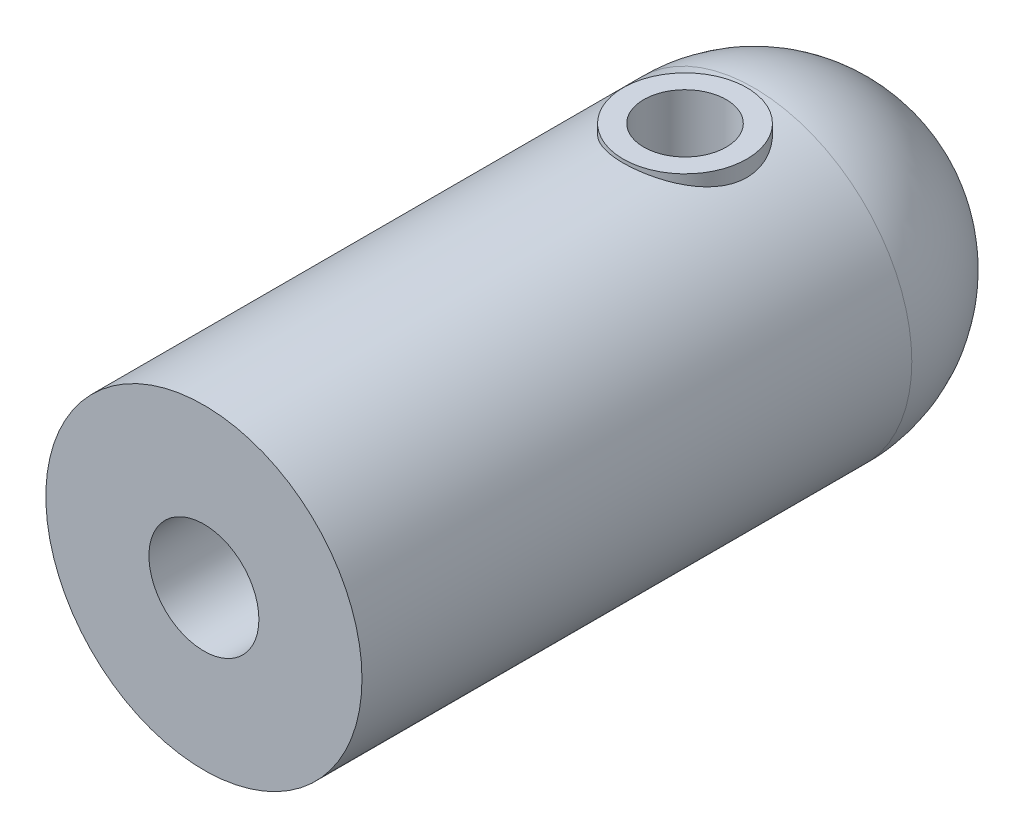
ISO-10303-21;
HEADER;
FILE_DESCRIPTION(('STEP AP214'),'2;1');
FILE_NAME('part.step','',(''),(''),'','','');
FILE_SCHEMA(('AUTOMOTIVE_DESIGN { 1 0 10303 214 1 1 1 1 }'));
ENDSEC;
DATA;
#1=APPLICATION_CONTEXT('core data for automotive mechanical design processes');
#2=APPLICATION_PROTOCOL_DEFINITION('international standard','automotive_design',2000,#1);
#3=PRODUCT_CONTEXT('',#1,'mechanical');
#4=PRODUCT('Part','Part','',(#3));
#5=PRODUCT_RELATED_PRODUCT_CATEGORY('part','',(#4));
#6=PRODUCT_DEFINITION_FORMATION('','',#4);
#7=PRODUCT_DEFINITION_CONTEXT('part definition',#1,'design');
#8=PRODUCT_DEFINITION('design','',#6,#7);
#9=PRODUCT_DEFINITION_SHAPE('','',#8);
#10=(LENGTH_UNIT() NAMED_UNIT(*) SI_UNIT(.MILLI.,.METRE.));
#11=(NAMED_UNIT(*) PLANE_ANGLE_UNIT() SI_UNIT($,.RADIAN.));
#12=(NAMED_UNIT(*) SI_UNIT($,.STERADIAN.) SOLID_ANGLE_UNIT());
#13=UNCERTAINTY_MEASURE_WITH_UNIT(LENGTH_MEASURE(1.E-05),#10,'distance_accuracy_value','');
#14=(GEOMETRIC_REPRESENTATION_CONTEXT(3) GLOBAL_UNCERTAINTY_ASSIGNED_CONTEXT((#13)) GLOBAL_UNIT_ASSIGNED_CONTEXT((#10,
#11,#12)) REPRESENTATION_CONTEXT('',''));
#15=CARTESIAN_POINT('',(0.,0.,0.));
#16=DIRECTION('',(0.,0.,1.));
#17=DIRECTION('',(1.,0.,0.));
#18=AXIS2_PLACEMENT_3D('',#15,#16,#17);
#19=CARTESIAN_POINT('',(0.,0.,80.));
#20=DIRECTION('',(0.,0.,-1.));
#21=DIRECTION('',(-1.,0.,0.));
#22=AXIS2_PLACEMENT_3D('',#19,#20,#21);
#23=CYLINDRICAL_SURFACE('',#22,23.);
#24=CARTESIAN_POINT('',(0.,0.,0.));
#25=DIRECTION('',(0.,0.,1.));
#26=DIRECTION('',(1.,0.,0.));
#27=AXIS2_PLACEMENT_3D('',#24,#25,#26);
#28=CIRCLE('',#27,23.);
#29=CARTESIAN_POINT('',(23.,0.,0.));
#30=VERTEX_POINT('',#29);
#31=EDGE_CURVE('E67',#30,#30,#28,.T.);
#32=ORIENTED_EDGE('',*,*,#31,.T.);
#33=EDGE_LOOP('',(#32));
#34=FACE_BOUND('',#33,.T.);
#35=CARTESIAN_POINT('',(0.,0.,80.));
#36=DIRECTION('',(0.,0.,1.));
#37=DIRECTION('',(1.,0.,0.));
#38=AXIS2_PLACEMENT_3D('',#35,#36,#37);
#39=CIRCLE('',#38,23.);
#40=CARTESIAN_POINT('',(23.,0.,80.));
#41=VERTEX_POINT('',#40);
#42=EDGE_CURVE('E41',#41,#41,#39,.T.);
#43=ORIENTED_EDGE('',*,*,#42,.F.);
#44=EDGE_LOOP('',(#43));
#45=FACE_BOUND('',#44,.T.);
#46=CARTESIAN_POINT('',(0.,23.,19.));
#47=CARTESIAN_POINT('',(0.242913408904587,23.0000012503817,19.0000016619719));
#48=CARTESIAN_POINT('',(0.485805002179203,22.9961436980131,18.990158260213));
#49=CARTESIAN_POINT('',(0.969758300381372,22.9808215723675,18.9508934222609));
#50=CARTESIAN_POINT('',(1.21082007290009,22.9693572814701,18.921472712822));
#51=CARTESIAN_POINT('',(1.68926120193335,22.9391335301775,18.8433669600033));
#52=CARTESIAN_POINT('',(1.92664154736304,22.9203760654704,18.7946871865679));
#53=CARTESIAN_POINT('',(2.39611476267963,22.8760624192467,18.6785431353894));
#54=CARTESIAN_POINT('',(2.62820744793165,22.8505060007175,18.6110782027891));
#55=CARTESIAN_POINT('',(3.08501553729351,22.7933225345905,18.4581655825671));
#56=CARTESIAN_POINT('',(3.30974653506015,22.7617094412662,18.3727591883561));
#57=CARTESIAN_POINT('',(3.75105355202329,22.6931594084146,18.1845685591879));
#58=CARTESIAN_POINT('',(3.96762669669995,22.6562206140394,18.0817782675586));
#59=CARTESIAN_POINT('',(4.39124296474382,22.5779401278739,17.8596551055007));
#60=CARTESIAN_POINT('',(4.59828720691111,22.5365989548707,17.7403241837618));
#61=CARTESIAN_POINT('',(5.00180657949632,22.4504902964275,17.4859097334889));
#62=CARTESIAN_POINT('',(5.19827784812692,22.4057215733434,17.3508205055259));
#63=CARTESIAN_POINT('',(5.58735624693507,22.3119501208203,17.0599460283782));
#64=CARTESIAN_POINT('',(5.77947557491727,22.2628490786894,16.9035397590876));
#65=CARTESIAN_POINT('',(6.14999733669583,22.1633557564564,16.5756173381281));
#66=CARTESIAN_POINT('',(6.32839932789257,22.1129634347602,16.4041006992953));
#67=CARTESIAN_POINT('',(6.67056995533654,22.012163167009,16.0468750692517));
#68=CARTESIAN_POINT('',(6.83433124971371,21.9617552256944,15.8611590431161));
#69=CARTESIAN_POINT('',(7.14610539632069,21.8622951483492,15.4767151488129));
#70=CARTESIAN_POINT('',(7.29412351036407,21.8132425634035,15.2779916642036));
#71=CARTESIAN_POINT('',(7.57951436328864,21.715770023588,14.8598092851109));
#72=CARTESIAN_POINT('',(7.71616168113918,21.6674667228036,14.6398271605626));
#73=CARTESIAN_POINT('',(7.97028137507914,21.575284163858,14.1882815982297));
#74=CARTESIAN_POINT('',(8.08776149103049,21.531403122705,13.9567228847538));
#75=CARTESIAN_POINT('',(8.30258552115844,21.4494824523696,13.4834736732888));
#76=CARTESIAN_POINT('',(8.39993193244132,21.41144209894,13.2417844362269));
#77=CARTESIAN_POINT('',(8.57354737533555,21.3425167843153,12.7499598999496));
#78=CARTESIAN_POINT('',(8.64981776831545,21.3116313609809,12.4998251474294));
#79=CARTESIAN_POINT('',(8.77758639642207,21.2593164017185,12.0041414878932));
#80=CARTESIAN_POINT('',(8.83002395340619,21.2375317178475,11.7588721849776));
#81=CARTESIAN_POINT('',(8.9142960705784,21.2022975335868,11.2642233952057));
#82=CARTESIAN_POINT('',(8.94613120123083,21.1888478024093,11.0148440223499));
#83=CARTESIAN_POINT('',(8.98881807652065,21.1707744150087,10.5140753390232));
#84=CARTESIAN_POINT('',(8.9996781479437,21.1661472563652,10.2626868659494));
#85=CARTESIAN_POINT('',(9.00030770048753,21.1658797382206,9.75988428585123));
#86=CARTESIAN_POINT('',(8.99007810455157,21.170238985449,9.50847018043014));
#87=CARTESIAN_POINT('',(8.9500333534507,21.1871972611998,9.02432935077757));
#88=CARTESIAN_POINT('',(8.92156333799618,21.1992301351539,8.79146994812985));
#89=CARTESIAN_POINT('',(8.84663246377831,21.2306086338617,8.32908254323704));
#90=CARTESIAN_POINT('',(8.80016536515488,21.2499567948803,8.09955572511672));
#91=CARTESIAN_POINT('',(8.68970417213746,21.2953656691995,7.64551024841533));
#92=CARTESIAN_POINT('',(8.62571458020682,21.3214246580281,7.4209903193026));
#93=CARTESIAN_POINT('',(8.48074727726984,21.3794999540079,6.97820949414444));
#94=CARTESIAN_POINT('',(8.39976304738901,21.4115185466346,6.75995103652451));
#95=CARTESIAN_POINT('',(8.21973587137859,21.4812810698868,6.32685315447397));
#96=CARTESIAN_POINT('',(8.12037138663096,21.5191245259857,6.11216354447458));
#97=CARTESIAN_POINT('',(7.90539571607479,21.5990246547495,5.69181371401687));
#98=CARTESIAN_POINT('',(7.7897790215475,21.6410827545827,5.48615658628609));
#99=CARTESIAN_POINT('',(7.54308670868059,21.7282984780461,5.08499255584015));
#100=CARTESIAN_POINT('',(7.41200908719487,21.7734565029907,4.88948697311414));
#101=CARTESIAN_POINT('',(7.13519874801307,21.8657316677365,4.50962890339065));
#102=CARTESIAN_POINT('',(6.98946537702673,21.9128488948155,4.32527691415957));
#103=CARTESIAN_POINT('',(6.67285447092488,22.0114172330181,3.95545190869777));
#104=CARTESIAN_POINT('',(6.50091452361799,22.0629311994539,3.77090384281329));
#105=CARTESIAN_POINT('',(6.1421464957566,22.1654873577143,3.41687511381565));
#106=CARTESIAN_POINT('',(5.95532286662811,22.2165296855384,3.24738997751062));
#107=CARTESIAN_POINT('',(5.56770760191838,22.316826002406,2.92438638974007));
#108=CARTESIAN_POINT('',(5.36690820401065,22.3660789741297,2.77087693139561));
#109=CARTESIAN_POINT('',(4.95268367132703,22.4614351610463,2.48103764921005));
#110=CARTESIAN_POINT('',(4.73926362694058,22.5075396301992,2.34470096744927));
#111=CARTESIAN_POINT('',(4.29690439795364,22.5962039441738,2.08777868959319));
#112=CARTESIAN_POINT('',(4.06774970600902,22.6386814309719,1.96753512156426));
#113=CARTESIAN_POINT('',(3.59920700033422,22.7178812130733,1.74695675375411));
#114=CARTESIAN_POINT('',(3.35982339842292,22.7546059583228,1.64661347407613));
#115=CARTESIAN_POINT('',(2.87247466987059,22.8212479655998,1.46675095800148));
#116=CARTESIAN_POINT('',(2.62451100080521,22.8511663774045,1.38722820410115));
#117=CARTESIAN_POINT('',(2.12186963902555,22.9033074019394,1.24982645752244));
#118=CARTESIAN_POINT('',(1.86719238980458,22.9255305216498,1.19194603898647));
#119=CARTESIAN_POINT('',(1.36788409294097,22.9605729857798,1.10114847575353));
#120=CARTESIAN_POINT('',(1.12351000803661,22.9738569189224,1.06699440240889));
#121=CARTESIAN_POINT('',(0.632486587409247,22.9926142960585,1.01886381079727));
#122=CARTESIAN_POINT('',(0.385837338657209,22.9980880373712,1.00488652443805));
#123=CARTESIAN_POINT('',(-0.107769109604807,23.0010714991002,0.997261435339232));
#124=CARTESIAN_POINT('',(-0.354726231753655,22.9985829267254,1.00360927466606));
#125=CARTESIAN_POINT('',(-0.847075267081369,22.9857151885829,1.0365557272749));
#126=CARTESIAN_POINT('',(-1.09246720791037,22.9753361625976,1.06315398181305));
#127=CARTESIAN_POINT('',(-1.56935068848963,22.9475865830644,1.1347439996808));
#128=CARTESIAN_POINT('',(-1.80098720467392,22.9305347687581,1.17889851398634));
#129=CARTESIAN_POINT('',(-2.25961975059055,22.8898915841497,1.28509649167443));
#130=CARTESIAN_POINT('',(-2.48661412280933,22.8662979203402,1.34714622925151));
#131=CARTESIAN_POINT('',(-2.93434964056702,22.813163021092,1.48855501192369));
#132=CARTESIAN_POINT('',(-3.15509256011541,22.7836234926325,1.56790908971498));
#133=CARTESIAN_POINT('',(-3.58914028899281,22.719292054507,1.74331254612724));
#134=CARTESIAN_POINT('',(-3.80244223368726,22.6844981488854,1.83936827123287));
#135=CARTESIAN_POINT('',(-4.22655580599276,22.6093781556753,2.05053430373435));
#136=CARTESIAN_POINT('',(-4.43710300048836,22.5689179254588,2.1661278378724));
#137=CARTESIAN_POINT('',(-4.84781833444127,22.4842754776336,2.41342353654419));
#138=CARTESIAN_POINT('',(-5.04798288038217,22.4400919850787,2.54513122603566));
#139=CARTESIAN_POINT('',(-5.43682041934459,22.3490685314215,2.82377517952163));
#140=CARTESIAN_POINT('',(-5.6254915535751,22.3022281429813,2.97071389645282));
#141=CARTESIAN_POINT('',(-5.99033393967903,22.2070135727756,3.27891890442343));
#142=CARTESIAN_POINT('',(-6.16650465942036,22.1586393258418,3.44018580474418));
#143=CARTESIAN_POINT('',(-6.51619009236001,22.0584318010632,3.78681601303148));
#144=CARTESIAN_POINT('',(-6.6888269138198,22.006573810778,3.97305901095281));
#145=CARTESIAN_POINT('',(-7.01782262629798,21.9038777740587,4.35956088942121));
#146=CARTESIAN_POINT('',(-7.17418662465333,21.8530394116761,4.55981533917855));
#147=CARTESIAN_POINT('',(-7.46976593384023,21.7537794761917,4.9733487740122));
#148=CARTESIAN_POINT('',(-7.60897185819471,21.7053592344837,5.18663479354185));
#149=CARTESIAN_POINT('',(-7.86907660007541,21.612420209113,5.6247844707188));
#150=CARTESIAN_POINT('',(-7.98998311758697,21.5678997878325,5.84964320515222));
#151=CARTESIAN_POINT('',(-8.21348545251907,21.4837855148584,6.31150416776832));
#152=CARTESIAN_POINT('',(-8.31592457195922,21.4442346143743,6.54859019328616));
#153=CARTESIAN_POINT('',(-8.50027730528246,21.3718295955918,7.03149123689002));
#154=CARTESIAN_POINT('',(-8.58220015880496,21.3389724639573,7.27730226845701));
#155=CARTESIAN_POINT('',(-8.72469871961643,21.2811079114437,7.77585518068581));
#156=CARTESIAN_POINT('',(-8.78528190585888,21.2560977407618,8.02859459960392));
#157=CARTESIAN_POINT('',(-8.88443720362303,21.2148455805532,8.53905538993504));
#158=CARTESIAN_POINT('',(-8.92301104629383,21.1986029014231,8.79677636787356));
#159=CARTESIAN_POINT('',(-8.9757806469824,21.1763102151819,9.29702827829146));
#160=CARTESIAN_POINT('',(-8.99148114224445,21.1696316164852,9.5393735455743));
#161=CARTESIAN_POINT('',(-9.00323750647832,21.1646346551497,10.0246210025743));
#162=CARTESIAN_POINT('',(-8.99929432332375,21.1663158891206,10.2675231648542));
#163=CARTESIAN_POINT('',(-8.97181035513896,21.1779800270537,10.7519848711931));
#164=CARTESIAN_POINT('',(-8.94827165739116,21.1879620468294,10.9935445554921));
#165=CARTESIAN_POINT('',(-8.88185990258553,21.2158869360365,11.4735202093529));
#166=CARTESIAN_POINT('',(-8.83898690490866,21.2338297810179,11.7119361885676));
#167=CARTESIAN_POINT('',(-8.73626967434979,21.2762909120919,12.1752779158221));
#168=CARTESIAN_POINT('',(-8.6771018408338,21.3005453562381,12.4003784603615));
#169=CARTESIAN_POINT('',(-8.54175281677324,21.355181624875,12.8447187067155));
#170=CARTESIAN_POINT('',(-8.46556567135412,21.385565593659,13.0639563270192));
#171=CARTESIAN_POINT('',(-8.29682409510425,21.45159455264,13.4951815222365));
#172=CARTESIAN_POINT('',(-8.20427241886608,21.4872386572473,13.7071703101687));
#173=CARTESIAN_POINT('',(-8.00347964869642,21.5628341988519,14.1228215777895));
#174=CARTESIAN_POINT('',(-7.89523245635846,21.6027873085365,14.3264807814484));
#175=CARTESIAN_POINT('',(-7.53522015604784,21.7321848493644,14.9453108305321));
#176=CARTESIAN_POINT('',(-7.25744600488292,21.8273690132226,15.344518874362));
#177=CARTESIAN_POINT('',(-6.64199123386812,22.0224387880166,16.0925106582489));
#178=CARTESIAN_POINT('',(-6.304290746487,22.1223259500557,16.4412776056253));
#179=CARTESIAN_POINT('',(-5.74756276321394,22.2711838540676,16.9304906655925));
#180=CARTESIAN_POINT('',(-5.54714380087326,22.3220663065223,17.0919329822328));
#181=CARTESIAN_POINT('',(-5.13278537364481,22.4209679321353,17.3973428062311));
#182=CARTESIAN_POINT('',(-4.91885091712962,22.4689881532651,17.5413167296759));
#183=CARTESIAN_POINT('',(-4.47860533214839,22.5608665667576,17.8108106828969));
#184=CARTESIAN_POINT('',(-4.2522858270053,22.604721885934,17.9363180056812));
#185=CARTESIAN_POINT('',(-3.78896939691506,22.6869795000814,18.1676633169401));
#186=CARTESIAN_POINT('',(-3.55197692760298,22.7253840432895,18.2735094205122));
#187=CARTESIAN_POINT('',(-3.04919103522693,22.7985104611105,18.4723863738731));
#188=CARTESIAN_POINT('',(-2.78262351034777,22.8326781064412,18.5636727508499));
#189=CARTESIAN_POINT('',(-2.24115631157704,22.8921689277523,18.7210498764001));
#190=CARTESIAN_POINT('',(-1.96625590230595,22.9174913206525,18.7871383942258));
#191=CARTESIAN_POINT('',(-1.4108931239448,22.9583723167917,18.893214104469));
#192=CARTESIAN_POINT('',(-1.13043376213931,22.9739360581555,18.9332150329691));
#193=CARTESIAN_POINT('',(-0.566639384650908,22.9947483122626,18.9866047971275));
#194=CARTESIAN_POINT('',(-0.283304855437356,22.9999985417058,18.9999980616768));
#195=CARTESIAN_POINT('',(0.,23.,19.));
#196=B_SPLINE_CURVE_WITH_KNOTS('',3,(#46,#47,#48,#49,#50,#51,#52,#53,#54,#55,#56,#57,#58,#59,
#60,#61,#62,#63,#64,#65,#66,#67,#68,#69,#70,#71,#72,#73,#74,#75,#76,#77,#78,#79,#80,#81,#82,#83,
#84,#85,#86,#87,#88,#89,#90,#91,#92,#93,#94,#95,#96,#97,#98,#99,#100,#101,#102,#103,#104,#105,
#106,#107,#108,#109,#110,#111,#112,#113,#114,#115,#116,#117,#118,#119,#120,#121,#122,#123,#124,
#125,#126,#127,#128,#129,#130,#131,#132,#133,#134,#135,#136,#137,#138,#139,#140,#141,#142,#143,
#144,#145,#146,#147,#148,#149,#150,#151,#152,#153,#154,#155,#156,#157,#158,#159,#160,#161,#162,
#163,#164,#165,#166,#167,#168,#169,#170,#171,#172,#173,#174,#175,#176,#177,#178,#179,#180,#181,
#182,#183,#184,#185,#186,#187,#188,#189,#190,#191,#192,#193,#194,#195),.UNSPECIFIED.,.T.,.F.,(4,
2,2,2,2,2,2,2,2,2,2,2,2,2,2,2,2,2,2,2,2,2,2,2,2,2,2,2,2,2,2,2,2,2,2,2,2,2,2,2,2,2,2,2,2,2,2,2,2,
2,2,2,2,2,2,2,2,2,2,2,2,2,2,2,2,2,2,2,2,2,2,2,2,2,4),(0.,0.728473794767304,1.45692054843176,
2.18516811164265,2.91344106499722,3.6400558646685,4.36692434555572,5.09370726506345,
5.82075386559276,6.57757676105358,7.33442406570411,8.09164880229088,8.84861965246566,
9.63794512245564,10.4269510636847,11.2158590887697,12.0047161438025,12.758994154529,
13.5132512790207,14.2672089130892,15.0211335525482,15.7250135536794,16.4291378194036,
17.1330813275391,17.8372953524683,18.5552504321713,19.2734494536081,19.9917416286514,
20.7100658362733,21.481501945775,22.2527081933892,23.0243462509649,23.7956751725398,
24.5814208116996,25.3668309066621,26.1521082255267,26.9373337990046,27.6777127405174,
28.4180634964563,29.1582555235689,29.8984344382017,30.6068877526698,31.3155897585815,
32.0240885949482,32.7328572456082,33.4627845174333,34.1929627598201,34.923258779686,
35.6535858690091,36.4302557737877,37.2066811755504,37.9835294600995,38.7600499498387,
39.542877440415,40.3253517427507,41.1075515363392,41.88968979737,42.6176017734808,
43.3454786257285,44.0732779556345,44.801075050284,45.5023136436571,46.2037979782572,
46.9051643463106,47.606803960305,49.0867156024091,50.5671188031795,51.3533233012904,
52.1392381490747,52.9256912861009,53.711819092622,54.5619371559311,55.4121304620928,
56.2618757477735,57.1114795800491),.UNSPECIFIED.);
#197=CARTESIAN_POINT('',(0.,23.,19.));
#198=VERTEX_POINT('',#197);
#199=EDGE_CURVE('E74',#198,#198,#196,.T.);
#200=ORIENTED_EDGE('',*,*,#199,.F.);
#201=EDGE_LOOP('',(#200));
#202=FACE_BOUND('',#201,.T.);
#203=CARTESIAN_POINT('',(0.,-23.,1.));
#204=CARTESIAN_POINT('',(0.242913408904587,-23.0000012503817,0.999998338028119));
#205=CARTESIAN_POINT('',(0.485805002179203,-22.9961436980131,1.00984173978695));
#206=CARTESIAN_POINT('',(0.969758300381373,-22.9808215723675,1.04910657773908));
#207=CARTESIAN_POINT('',(1.21082007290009,-22.9693572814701,1.07852728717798));
#208=CARTESIAN_POINT('',(1.68926120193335,-22.9391335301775,1.15663303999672));
#209=CARTESIAN_POINT('',(1.92664154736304,-22.9203760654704,1.20531281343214));
#210=CARTESIAN_POINT('',(2.39611476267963,-22.8760624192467,1.32145686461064));
#211=CARTESIAN_POINT('',(2.62820744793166,-22.8505060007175,1.38892179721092));
#212=CARTESIAN_POINT('',(3.08501553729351,-22.7933225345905,1.54183441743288));
#213=CARTESIAN_POINT('',(3.30974653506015,-22.7617094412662,1.6272408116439));
#214=CARTESIAN_POINT('',(3.75105355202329,-22.6931594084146,1.81543144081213));
#215=CARTESIAN_POINT('',(3.96762669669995,-22.6562206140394,1.91822173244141));
#216=CARTESIAN_POINT('',(4.39124296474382,-22.5779401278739,2.14034489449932));
#217=CARTESIAN_POINT('',(4.59828720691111,-22.5365989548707,2.25967581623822));
#218=CARTESIAN_POINT('',(5.00180657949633,-22.4504902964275,2.5140902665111));
#219=CARTESIAN_POINT('',(5.19827784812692,-22.4057215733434,2.64917949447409));
#220=CARTESIAN_POINT('',(5.58735624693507,-22.3119501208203,2.94005397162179));
#221=CARTESIAN_POINT('',(5.77947557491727,-22.2628490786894,3.09646024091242));
#222=CARTESIAN_POINT('',(6.14999733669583,-22.1633557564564,3.42438266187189));
#223=CARTESIAN_POINT('',(6.32839932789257,-22.1129634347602,3.59589930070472));
#224=CARTESIAN_POINT('',(6.67056995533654,-22.012163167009,3.95312493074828));
#225=CARTESIAN_POINT('',(6.83433124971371,-21.9617552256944,4.13884095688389));
#226=CARTESIAN_POINT('',(7.14610539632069,-21.8622951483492,4.52328485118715));
#227=CARTESIAN_POINT('',(7.29412351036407,-21.8132425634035,4.72200833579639));
#228=CARTESIAN_POINT('',(7.57951436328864,-21.715770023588,5.14019071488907));
#229=CARTESIAN_POINT('',(7.71616168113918,-21.6674667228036,5.36017283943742));
#230=CARTESIAN_POINT('',(7.97028137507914,-21.575284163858,5.81171840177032));
#231=CARTESIAN_POINT('',(8.08776149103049,-21.531403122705,6.04327711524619));
#232=CARTESIAN_POINT('',(8.30258552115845,-21.4494824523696,6.5165263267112));
#233=CARTESIAN_POINT('',(8.39993193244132,-21.41144209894,6.75821556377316));
#234=CARTESIAN_POINT('',(8.57354737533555,-21.3425167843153,7.25004010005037));
#235=CARTESIAN_POINT('',(8.64981776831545,-21.3116313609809,7.50017485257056));
#236=CARTESIAN_POINT('',(8.77758639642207,-21.2593164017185,7.99585851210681));
#237=CARTESIAN_POINT('',(8.83002395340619,-21.2375317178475,8.24112781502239));
#238=CARTESIAN_POINT('',(8.9142960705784,-21.2022975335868,8.73577660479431));
#239=CARTESIAN_POINT('',(8.94613120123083,-21.1888478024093,8.9851559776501));
#240=CARTESIAN_POINT('',(8.98881807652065,-21.1707744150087,9.48592466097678));
#241=CARTESIAN_POINT('',(8.9996781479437,-21.1661472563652,9.73731313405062));
#242=CARTESIAN_POINT('',(9.00030770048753,-21.1658797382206,10.2401157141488));
#243=CARTESIAN_POINT('',(8.99007810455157,-21.170238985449,10.4915298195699));
#244=CARTESIAN_POINT('',(8.9500333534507,-21.1871972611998,10.9756706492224));
#245=CARTESIAN_POINT('',(8.92156333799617,-21.1992301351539,11.2085300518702));
#246=CARTESIAN_POINT('',(8.84663246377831,-21.2306086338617,11.670917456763));
#247=CARTESIAN_POINT('',(8.80016536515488,-21.2499567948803,11.9004442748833));
#248=CARTESIAN_POINT('',(8.68970417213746,-21.2953656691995,12.3544897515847));
#249=CARTESIAN_POINT('',(8.62571458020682,-21.3214246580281,12.5790096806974));
#250=CARTESIAN_POINT('',(8.48074727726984,-21.3794999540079,13.0217905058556));
#251=CARTESIAN_POINT('',(8.39976304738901,-21.4115185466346,13.2400489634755));
#252=CARTESIAN_POINT('',(8.21973587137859,-21.4812810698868,13.673146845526));
#253=CARTESIAN_POINT('',(8.12037138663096,-21.5191245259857,13.8878364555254));
#254=CARTESIAN_POINT('',(7.90539571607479,-21.5990246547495,14.3081862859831));
#255=CARTESIAN_POINT('',(7.78977902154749,-21.6410827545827,14.5138434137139));
#256=CARTESIAN_POINT('',(7.54308670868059,-21.7282984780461,14.9150074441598));
#257=CARTESIAN_POINT('',(7.41200908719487,-21.7734565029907,15.1105130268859));
#258=CARTESIAN_POINT('',(7.13519874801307,-21.8657316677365,15.4903710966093));
#259=CARTESIAN_POINT('',(6.98946537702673,-21.9128488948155,15.6747230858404));
#260=CARTESIAN_POINT('',(6.67285447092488,-22.0114172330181,16.0445480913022));
#261=CARTESIAN_POINT('',(6.50091452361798,-22.0629311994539,16.2290961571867));
#262=CARTESIAN_POINT('',(6.14214649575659,-22.1654873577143,16.5831248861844));
#263=CARTESIAN_POINT('',(5.95532286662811,-22.2165296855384,16.7526100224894));
#264=CARTESIAN_POINT('',(5.56770760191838,-22.316826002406,17.0756136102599));
#265=CARTESIAN_POINT('',(5.36690820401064,-22.3660789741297,17.2291230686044));
#266=CARTESIAN_POINT('',(4.95268367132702,-22.4614351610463,17.51896235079));
#267=CARTESIAN_POINT('',(4.73926362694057,-22.5075396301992,17.6552990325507));
#268=CARTESIAN_POINT('',(4.29690439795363,-22.5962039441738,17.9122213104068));
#269=CARTESIAN_POINT('',(4.06774970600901,-22.6386814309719,18.0324648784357));
#270=CARTESIAN_POINT('',(3.59920700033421,-22.7178812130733,18.2530432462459));
#271=CARTESIAN_POINT('',(3.35982339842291,-22.7546059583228,18.3533865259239));
#272=CARTESIAN_POINT('',(2.87247466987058,-22.8212479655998,18.5332490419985));
#273=CARTESIAN_POINT('',(2.62451100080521,-22.8511663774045,18.6127717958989));
#274=CARTESIAN_POINT('',(2.12186963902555,-22.9033074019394,18.7501735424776));
#275=CARTESIAN_POINT('',(1.86719238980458,-22.9255305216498,18.8080539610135));
#276=CARTESIAN_POINT('',(1.36788409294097,-22.9605729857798,18.8988515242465));
#277=CARTESIAN_POINT('',(1.1235100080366,-22.9738569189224,18.9330055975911));
#278=CARTESIAN_POINT('',(0.632486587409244,-22.9926142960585,18.9811361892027));
#279=CARTESIAN_POINT('',(0.385837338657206,-22.9980880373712,18.9951134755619));
#280=CARTESIAN_POINT('',(-0.10776910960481,-23.0010714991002,19.0027385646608));
#281=CARTESIAN_POINT('',(-0.354726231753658,-22.9985829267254,18.9963907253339));
#282=CARTESIAN_POINT('',(-0.847075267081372,-22.9857151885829,18.9634442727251));
#283=CARTESIAN_POINT('',(-1.09246720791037,-22.9753361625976,18.9368460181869));
#284=CARTESIAN_POINT('',(-1.56935068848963,-22.9475865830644,18.8652560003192));
#285=CARTESIAN_POINT('',(-1.80098720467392,-22.9305347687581,18.8211014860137));
#286=CARTESIAN_POINT('',(-2.25961975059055,-22.8898915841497,18.7149035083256));
#287=CARTESIAN_POINT('',(-2.48661412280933,-22.8662979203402,18.6528537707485));
#288=CARTESIAN_POINT('',(-2.93434964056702,-22.813163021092,18.5114449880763));
#289=CARTESIAN_POINT('',(-3.15509256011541,-22.7836234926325,18.432090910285));
#290=CARTESIAN_POINT('',(-3.58914028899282,-22.719292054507,18.2566874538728));
#291=CARTESIAN_POINT('',(-3.80244223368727,-22.6844981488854,18.1606317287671));
#292=CARTESIAN_POINT('',(-4.22655580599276,-22.6093781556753,17.9494656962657));
#293=CARTESIAN_POINT('',(-4.43710300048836,-22.5689179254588,17.8338721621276));
#294=CARTESIAN_POINT('',(-4.84781833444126,-22.4842754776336,17.5865764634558));
#295=CARTESIAN_POINT('',(-5.04798288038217,-22.4400919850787,17.4548687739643));
#296=CARTESIAN_POINT('',(-5.43682041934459,-22.3490685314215,17.1762248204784));
#297=CARTESIAN_POINT('',(-5.6254915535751,-22.3022281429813,17.0292861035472));
#298=CARTESIAN_POINT('',(-5.99033393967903,-22.2070135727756,16.7210810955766));
#299=CARTESIAN_POINT('',(-6.16650465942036,-22.1586393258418,16.5598141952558));
#300=CARTESIAN_POINT('',(-6.51619009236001,-22.0584318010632,16.2131839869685));
#301=CARTESIAN_POINT('',(-6.6888269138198,-22.006573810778,16.0269409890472));
#302=CARTESIAN_POINT('',(-7.01782262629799,-21.9038777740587,15.6404391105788));
#303=CARTESIAN_POINT('',(-7.17418662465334,-21.8530394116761,15.4401846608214));
#304=CARTESIAN_POINT('',(-7.46976593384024,-21.7537794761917,15.0266512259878));
#305=CARTESIAN_POINT('',(-7.60897185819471,-21.7053592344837,14.8133652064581));
#306=CARTESIAN_POINT('',(-7.86907660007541,-21.612420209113,14.3752155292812));
#307=CARTESIAN_POINT('',(-7.98998311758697,-21.5678997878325,14.1503567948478));
#308=CARTESIAN_POINT('',(-8.21348545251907,-21.4837855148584,13.6884958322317));
#309=CARTESIAN_POINT('',(-8.31592457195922,-21.4442346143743,13.4514098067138));
#310=CARTESIAN_POINT('',(-8.50027730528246,-21.3718295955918,12.96850876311));
#311=CARTESIAN_POINT('',(-8.58220015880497,-21.3389724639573,12.722697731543));
#312=CARTESIAN_POINT('',(-8.72469871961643,-21.2811079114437,12.2241448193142));
#313=CARTESIAN_POINT('',(-8.78528190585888,-21.2560977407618,11.9714054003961));
#314=CARTESIAN_POINT('',(-8.88443720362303,-21.2148455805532,11.460944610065));
#315=CARTESIAN_POINT('',(-8.92301104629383,-21.1986029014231,11.2032236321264));
#316=CARTESIAN_POINT('',(-8.9757806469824,-21.1763102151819,10.7029717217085));
#317=CARTESIAN_POINT('',(-8.99148114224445,-21.1696316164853,10.4606264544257));
#318=CARTESIAN_POINT('',(-9.00323750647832,-21.1646346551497,9.97537899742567));
#319=CARTESIAN_POINT('',(-8.99929432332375,-21.1663158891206,9.73247683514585));
#320=CARTESIAN_POINT('',(-8.97181035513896,-21.1779800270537,9.24801512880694));
#321=CARTESIAN_POINT('',(-8.94827165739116,-21.1879620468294,9.00645544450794));
#322=CARTESIAN_POINT('',(-8.88185990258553,-21.2158869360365,8.52647979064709));
#323=CARTESIAN_POINT('',(-8.83898690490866,-21.2338297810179,8.28806381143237));
#324=CARTESIAN_POINT('',(-8.7362696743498,-21.2762909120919,7.82472208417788));
#325=CARTESIAN_POINT('',(-8.6771018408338,-21.3005453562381,7.59962153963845));
#326=CARTESIAN_POINT('',(-8.54175281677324,-21.355181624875,7.1552812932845));
#327=CARTESIAN_POINT('',(-8.46556567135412,-21.385565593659,6.93604367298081));
#328=CARTESIAN_POINT('',(-8.29682409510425,-21.45159455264,6.50481847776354));
#329=CARTESIAN_POINT('',(-8.20427241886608,-21.4872386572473,6.29282968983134));
#330=CARTESIAN_POINT('',(-8.00347964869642,-21.5628341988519,5.87717842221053));
#331=CARTESIAN_POINT('',(-7.89523245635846,-21.6027873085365,5.67351921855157));
#332=CARTESIAN_POINT('',(-7.53522015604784,-21.7321848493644,5.05468916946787));
#333=CARTESIAN_POINT('',(-7.25744600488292,-21.8273690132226,4.65548112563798));
#334=CARTESIAN_POINT('',(-6.64199123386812,-22.0224387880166,3.90748934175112));
#335=CARTESIAN_POINT('',(-6.304290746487,-22.1223259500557,3.55872239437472));
#336=CARTESIAN_POINT('',(-5.74756276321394,-22.2711838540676,3.06950933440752));
#337=CARTESIAN_POINT('',(-5.54714380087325,-22.3220663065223,2.90806701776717));
#338=CARTESIAN_POINT('',(-5.1327853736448,-22.4209679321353,2.60265719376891));
#339=CARTESIAN_POINT('',(-4.91885091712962,-22.4689881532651,2.45868327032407));
#340=CARTESIAN_POINT('',(-4.47860533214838,-22.5608665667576,2.18918931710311));
#341=CARTESIAN_POINT('',(-4.2522858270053,-22.604721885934,2.06368199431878));
#342=CARTESIAN_POINT('',(-3.78896939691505,-22.6869795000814,1.83233668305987));
#343=CARTESIAN_POINT('',(-3.55197692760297,-22.7253840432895,1.72649057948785));
#344=CARTESIAN_POINT('',(-3.04919103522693,-22.7985104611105,1.52761362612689));
#345=CARTESIAN_POINT('',(-2.78262351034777,-22.8326781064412,1.43632724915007));
#346=CARTESIAN_POINT('',(-2.24115631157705,-22.8921689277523,1.27895012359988));
#347=CARTESIAN_POINT('',(-1.96625590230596,-22.9174913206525,1.21286160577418));
#348=CARTESIAN_POINT('',(-1.4108931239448,-22.9583723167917,1.10678589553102));
#349=CARTESIAN_POINT('',(-1.13043376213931,-22.9739360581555,1.06678496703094));
#350=CARTESIAN_POINT('',(-0.566639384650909,-22.9947483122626,1.01339520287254));
#351=CARTESIAN_POINT('',(-0.283304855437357,-22.9999985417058,1.00000193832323));
#352=CARTESIAN_POINT('',(0.,-23.,1.));
#353=B_SPLINE_CURVE_WITH_KNOTS('',3,(#203,#204,#205,#206,#207,#208,#209,#210,#211,#212,#213,
#214,#215,#216,#217,#218,#219,#220,#221,#222,#223,#224,#225,#226,#227,#228,#229,#230,#231,#232,
#233,#234,#235,#236,#237,#238,#239,#240,#241,#242,#243,#244,#245,#246,#247,#248,#249,#250,#251,
#252,#253,#254,#255,#256,#257,#258,#259,#260,#261,#262,#263,#264,#265,#266,#267,#268,#269,#270,
#271,#272,#273,#274,#275,#276,#277,#278,#279,#280,#281,#282,#283,#284,#285,#286,#287,#288,#289,
#290,#291,#292,#293,#294,#295,#296,#297,#298,#299,#300,#301,#302,#303,#304,#305,#306,#307,#308,
#309,#310,#311,#312,#313,#314,#315,#316,#317,#318,#319,#320,#321,#322,#323,#324,#325,#326,#327,
#328,#329,#330,#331,#332,#333,#334,#335,#336,#337,#338,#339,#340,#341,#342,#343,#344,#345,#346,
#347,#348,#349,#350,#351,#352),.UNSPECIFIED.,.T.,.F.,(4,2,2,2,2,2,2,2,2,2,2,2,2,2,2,2,2,2,2,2,2,
2,2,2,2,2,2,2,2,2,2,2,2,2,2,2,2,2,2,2,2,2,2,2,2,2,2,2,2,2,2,2,2,2,2,2,2,2,2,2,2,2,2,2,2,2,2,2,2,
2,2,2,2,2,4),(0.,0.728473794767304,1.45692054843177,2.18516811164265,2.91344106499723,
3.6400558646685,4.36692434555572,5.09370726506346,5.82075386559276,6.57757676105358,
7.33442406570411,8.09164880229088,8.84861965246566,9.63794512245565,10.4269510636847,
11.2158590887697,12.0047161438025,12.758994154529,13.5132512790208,14.2672089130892,
15.0211335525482,15.7250135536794,16.4291378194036,17.1330813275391,17.8372953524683,
18.5552504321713,19.2734494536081,19.9917416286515,20.7100658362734,21.481501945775,
22.2527081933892,23.0243462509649,23.7956751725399,24.5814208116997,25.3668309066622,
26.1521082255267,26.9373337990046,27.6777127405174,28.4180634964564,29.1582555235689,
29.8984344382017,30.6068877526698,31.3155897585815,32.0240885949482,32.7328572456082,
33.4627845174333,34.1929627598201,34.923258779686,35.6535858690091,36.4302557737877,
37.2066811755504,37.9835294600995,38.7600499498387,39.542877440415,40.3253517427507,
41.1075515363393,41.88968979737,42.6176017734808,43.3454786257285,44.0732779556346,
44.801075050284,45.5023136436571,46.2037979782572,46.9051643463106,47.606803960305,
49.0867156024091,50.5671188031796,51.3533233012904,52.1392381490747,52.9256912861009,
53.711819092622,54.5619371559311,55.4121304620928,56.2618757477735,57.1114795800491),.UNSPECIFIED.);
#354=CARTESIAN_POINT('',(0.,-23.,1.));
#355=VERTEX_POINT('',#354);
#356=EDGE_CURVE('E11',#355,#355,#353,.T.);
#357=ORIENTED_EDGE('',*,*,#356,.F.);
#358=EDGE_LOOP('',(#357));
#359=FACE_BOUND('',#358,.T.);
#360=ADVANCED_FACE('F31',(#34,#45,#202,#359),#23,.T.);
#361=CARTESIAN_POINT('',(0.,0.,80.));
#362=DIRECTION('',(0.,0.,1.));
#363=DIRECTION('',(1.,0.,0.));
#364=AXIS2_PLACEMENT_3D('',#361,#362,#363);
#365=PLANE('',#364);
#366=CARTESIAN_POINT('',(0.,0.,80.));
#367=DIRECTION('',(0.,0.,1.));
#368=DIRECTION('',(1.,0.,0.));
#369=AXIS2_PLACEMENT_3D('',#366,#367,#368);
#370=CIRCLE('',#369,8.);
#371=CARTESIAN_POINT('',(8.,0.,80.));
#372=VERTEX_POINT('',#371);
#373=EDGE_CURVE('E121',#372,#372,#370,.T.);
#374=ORIENTED_EDGE('',*,*,#373,.F.);
#375=EDGE_LOOP('',(#374));
#376=FACE_BOUND('',#375,.T.);
#377=ORIENTED_EDGE('',*,*,#42,.T.);
#378=EDGE_LOOP('',(#377));
#379=FACE_BOUND('',#378,.T.);
#380=ADVANCED_FACE('F58',(#376,#379),#365,.T.);
#381=CARTESIAN_POINT('',(0.,0.,-9.99999999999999));
#382=DIRECTION('',(0.,0.,1.));
#383=DIRECTION('',(1.,0.,0.));
#384=AXIS2_PLACEMENT_3D('',#381,#382,#383);
#385=CYLINDRICAL_SURFACE('',#384,8.);
#386=CARTESIAN_POINT('',(0.,0.,0.));
#387=DIRECTION('',(0.,0.,1.));
#388=DIRECTION('',(1.,0.,0.));
#389=AXIS2_PLACEMENT_3D('',#386,#387,#388);
#390=CIRCLE('',#389,8.);
#391=CARTESIAN_POINT('',(8.,0.,0.));
#392=VERTEX_POINT('',#391);
#393=EDGE_CURVE('E124',#392,#392,#390,.T.);
#394=CARTESIAN_POINT('',(8.,0.,80.));
#395=CARTESIAN_POINT('',(8.,0.,79.1666666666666));
#396=CARTESIAN_POINT('',(8.,0.,78.3333333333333));
#397=CARTESIAN_POINT('',(8.,0.,76.6666666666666));
#398=CARTESIAN_POINT('',(8.,0.,75.8333333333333));
#399=CARTESIAN_POINT('',(8.,0.,74.1666666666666));
#400=CARTESIAN_POINT('',(8.,0.,73.3333333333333));
#401=CARTESIAN_POINT('',(8.,0.,71.6666666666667));
#402=CARTESIAN_POINT('',(8.,0.,70.8333333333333));
#403=CARTESIAN_POINT('',(8.,0.,69.1666666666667));
#404=CARTESIAN_POINT('',(8.,0.,68.3333333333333));
#405=CARTESIAN_POINT('',(8.,0.,66.6666666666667));
#406=CARTESIAN_POINT('',(8.,0.,65.8333333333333));
#407=CARTESIAN_POINT('',(8.,0.,64.1666666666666));
#408=CARTESIAN_POINT('',(8.,0.,63.3333333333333));
#409=CARTESIAN_POINT('',(8.,0.,61.6666666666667));
#410=CARTESIAN_POINT('',(8.,0.,60.8333333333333));
#411=CARTESIAN_POINT('',(8.,0.,59.1666666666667));
#412=CARTESIAN_POINT('',(8.,0.,58.3333333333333));
#413=CARTESIAN_POINT('',(8.,0.,56.6666666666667));
#414=CARTESIAN_POINT('',(8.,0.,55.8333333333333));
#415=CARTESIAN_POINT('',(8.,0.,54.1666666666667));
#416=CARTESIAN_POINT('',(8.,0.,53.3333333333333));
#417=CARTESIAN_POINT('',(8.,0.,51.6666666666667));
#418=CARTESIAN_POINT('',(8.,0.,50.8333333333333));
#419=CARTESIAN_POINT('',(8.,0.,49.1666666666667));
#420=CARTESIAN_POINT('',(8.,0.,48.3333333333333));
#421=CARTESIAN_POINT('',(8.,0.,46.6666666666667));
#422=CARTESIAN_POINT('',(8.,0.,45.8333333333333));
#423=CARTESIAN_POINT('',(8.,0.,44.1666666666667));
#424=CARTESIAN_POINT('',(8.,0.,43.3333333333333));
#425=CARTESIAN_POINT('',(8.,0.,41.6666666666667));
#426=CARTESIAN_POINT('',(8.,0.,40.8333333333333));
#427=CARTESIAN_POINT('',(8.,0.,39.1666666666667));
#428=CARTESIAN_POINT('',(8.,0.,38.3333333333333));
#429=CARTESIAN_POINT('',(8.,0.,36.6666666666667));
#430=CARTESIAN_POINT('',(8.,0.,35.8333333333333));
#431=CARTESIAN_POINT('',(8.,0.,34.1666666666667));
#432=CARTESIAN_POINT('',(8.,0.,33.3333333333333));
#433=CARTESIAN_POINT('',(8.,0.,31.6666666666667));
#434=CARTESIAN_POINT('',(8.,0.,30.8333333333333));
#435=CARTESIAN_POINT('',(8.,0.,29.1666666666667));
#436=CARTESIAN_POINT('',(8.,0.,28.3333333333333));
#437=CARTESIAN_POINT('',(8.,0.,26.6666666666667));
#438=CARTESIAN_POINT('',(8.,0.,25.8333333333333));
#439=CARTESIAN_POINT('',(8.,0.,24.1666666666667));
#440=CARTESIAN_POINT('',(8.,0.,23.3333333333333));
#441=CARTESIAN_POINT('',(8.,0.,21.6666666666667));
#442=CARTESIAN_POINT('',(8.,0.,20.8333333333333));
#443=CARTESIAN_POINT('',(8.,0.,19.1666666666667));
#444=CARTESIAN_POINT('',(8.,0.,18.3333333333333));
#445=CARTESIAN_POINT('',(8.,0.,16.6666666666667));
#446=CARTESIAN_POINT('',(8.,0.,15.8333333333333));
#447=CARTESIAN_POINT('',(8.,0.,14.1666666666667));
#448=CARTESIAN_POINT('',(8.,0.,13.3333333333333));
#449=CARTESIAN_POINT('',(8.,0.,11.6666666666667));
#450=CARTESIAN_POINT('',(8.,0.,10.8333333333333));
#451=CARTESIAN_POINT('',(8.,0.,9.16666666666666));
#452=CARTESIAN_POINT('',(8.,0.,8.33333333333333));
#453=CARTESIAN_POINT('',(8.,0.,6.66666666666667));
#454=CARTESIAN_POINT('',(8.,0.,5.83333333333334));
#455=CARTESIAN_POINT('',(8.,0.,4.16666666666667));
#456=CARTESIAN_POINT('',(8.,0.,3.33333333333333));
#457=CARTESIAN_POINT('',(8.,0.,1.66666666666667));
#458=CARTESIAN_POINT('',(8.,0.,0.833333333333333));
#459=CARTESIAN_POINT('',(8.,0.,0.));
#460=B_SPLINE_CURVE_WITH_KNOTS('',3,(#394,#395,#396,#397,#398,#399,#400,#401,#402,#403,#404,
#405,#406,#407,#408,#409,#410,#411,#412,#413,#414,#415,#416,#417,#418,#419,#420,#421,#422,#423,
#424,#425,#426,#427,#428,#429,#430,#431,#432,#433,#434,#435,#436,#437,#438,#439,#440,#441,#442,
#443,#444,#445,#446,#447,#448,#449,#450,#451,#452,#453,#454,#455,#456,#457,#458,#459),
.UNSPECIFIED.,.F.,.F.,(4,2,2,2,2,2,2,2,2,2,2,2,2,2,2,2,2,2,2,2,2,2,2,2,2,2,2,2,2,2,2,2,4),(0.,
2.5,5.,7.50000000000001,9.99999999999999,12.5,15.,17.5,20.,22.5,25.,27.5,30.,32.5,35.,37.5,40.,
42.5,45.,47.5,50.,52.5,55.,57.5,60.,62.5,65.,67.5,70.,72.5,75.,77.5,80.),.UNSPECIFIED.);
#461=EDGE_CURVE('BSEAM63',#372,#392,#460,.T.);
#462=ORIENTED_EDGE('',*,*,#373,.T.);
#463=ORIENTED_EDGE('',*,*,#393,.F.);
#464=ORIENTED_EDGE('',*,*,#461,.T.);
#465=ORIENTED_EDGE('',*,*,#461,.F.);
#466=EDGE_LOOP('',(#462,#464,#463,#465));
#467=FACE_BOUND('',#466,.T.);
#468=ADVANCED_FACE('F63',(#467),#385,.F.);
#469=CARTESIAN_POINT('',(0.,23.5,10.));
#470=DIRECTION('',(0.,1.,0.));
#471=DIRECTION('',(0.,0.,1.));
#472=AXIS2_PLACEMENT_3D('',#469,#470,#471);
#473=PLANE('',#472);
#474=CARTESIAN_POINT('',(0.,23.5,10.));
#475=DIRECTION('',(0.,1.,0.));
#476=DIRECTION('',(0.,0.,1.));
#477=AXIS2_PLACEMENT_3D('',#474,#475,#476);
#478=CIRCLE('',#477,6.);
#479=CARTESIAN_POINT('',(0.,23.5,16.));
#480=VERTEX_POINT('',#479);
#481=EDGE_CURVE('E141',#480,#480,#478,.T.);
#482=ORIENTED_EDGE('',*,*,#481,.F.);
#483=EDGE_LOOP('',(#482));
#484=FACE_BOUND('',#483,.T.);
#485=CARTESIAN_POINT('',(0.,23.5,10.));
#486=DIRECTION('',(0.,1.,0.));
#487=DIRECTION('',(0.,0.,1.));
#488=AXIS2_PLACEMENT_3D('',#485,#486,#487);
#489=CIRCLE('',#488,9.);
#490=CARTESIAN_POINT('',(0.,23.5,19.));
#491=VERTEX_POINT('',#490);
#492=EDGE_CURVE('E116',#491,#491,#489,.T.);
#493=ORIENTED_EDGE('',*,*,#492,.T.);
#494=EDGE_LOOP('',(#493));
#495=FACE_BOUND('',#494,.T.);
#496=ADVANCED_FACE('F82',(#484,#495),#473,.T.);
#497=CARTESIAN_POINT('',(0.,-500000.,10.));
#498=DIRECTION('',(0.,1.,0.));
#499=DIRECTION('',(0.,0.,1.));
#500=AXIS2_PLACEMENT_3D('',#497,#498,#499);
#501=CYLINDRICAL_SURFACE('',#500,9.);
#502=ORIENTED_EDGE('',*,*,#492,.F.);
#503=EDGE_LOOP('',(#502));
#504=FACE_BOUND('',#503,.T.);
#505=ORIENTED_EDGE('',*,*,#199,.T.);
#506=EDGE_LOOP('',(#505));
#507=FACE_BOUND('',#506,.T.);
#508=ADVANCED_FACE('F90',(#504,#507),#501,.T.);
#509=CARTESIAN_POINT('',(0.,-23.5,10.));
#510=DIRECTION('',(0.,1.,0.));
#511=DIRECTION('',(0.,0.,1.));
#512=AXIS2_PLACEMENT_3D('',#509,#510,#511);
#513=PLANE('',#512);
#514=CARTESIAN_POINT('',(0.,-23.5,10.));
#515=DIRECTION('',(0.,-1.,0.));
#516=DIRECTION('',(0.,0.,-1.));
#517=AXIS2_PLACEMENT_3D('',#514,#515,#516);
#518=CIRCLE('',#517,6.);
#519=CARTESIAN_POINT('',(0.,-23.5,4.));
#520=VERTEX_POINT('',#519);
#521=EDGE_CURVE('E135',#520,#520,#518,.T.);
#522=ORIENTED_EDGE('',*,*,#521,.F.);
#523=EDGE_LOOP('',(#522));
#524=FACE_BOUND('',#523,.T.);
#525=CARTESIAN_POINT('',(0.,-23.5,10.));
#526=DIRECTION('',(0.,1.,0.));
#527=DIRECTION('',(0.,0.,1.));
#528=AXIS2_PLACEMENT_3D('',#525,#526,#527);
#529=CIRCLE('',#528,9.);
#530=CARTESIAN_POINT('',(0.,-23.5,19.));
#531=VERTEX_POINT('',#530);
#532=EDGE_CURVE('E117',#531,#531,#529,.T.);
#533=ORIENTED_EDGE('',*,*,#532,.F.);
#534=EDGE_LOOP('',(#533));
#535=FACE_BOUND('',#534,.T.);
#536=ADVANCED_FACE('F80',(#524,#535),#513,.F.);
#537=CARTESIAN_POINT('',(0.,500000.,10.));
#538=DIRECTION('',(0.,-1.,0.));
#539=DIRECTION('',(0.,0.,-1.));
#540=AXIS2_PLACEMENT_3D('',#537,#538,#539);
#541=CYLINDRICAL_SURFACE('',#540,9.);
#542=ORIENTED_EDGE('',*,*,#532,.T.);
#543=EDGE_LOOP('',(#542));
#544=FACE_BOUND('',#543,.T.);
#545=ORIENTED_EDGE('',*,*,#356,.T.);
#546=EDGE_LOOP('',(#545));
#547=FACE_BOUND('',#546,.T.);
#548=ADVANCED_FACE('F77',(#544,#547),#541,.T.);
#549=CARTESIAN_POINT('',(0.,-13.5,10.));
#550=DIRECTION('',(0.,-1.,0.));
#551=DIRECTION('',(0.,0.,-1.));
#552=AXIS2_PLACEMENT_3D('',#549,#550,#551);
#553=CYLINDRICAL_SURFACE('',#552,6.);
#554=CARTESIAN_POINT('',(0.,-13.5,10.));
#555=DIRECTION('',(0.,-1.,0.));
#556=DIRECTION('',(0.,0.,-1.));
#557=AXIS2_PLACEMENT_3D('',#554,#555,#556);
#558=CIRCLE('',#557,6.);
#559=CARTESIAN_POINT('',(0.,-13.5,4.));
#560=VERTEX_POINT('',#559);
#561=EDGE_CURVE('E132',#560,#560,#558,.T.);
#562=ORIENTED_EDGE('',*,*,#561,.F.);
#563=EDGE_LOOP('',(#562));
#564=FACE_BOUND('',#563,.T.);
#565=ORIENTED_EDGE('',*,*,#521,.T.);
#566=EDGE_LOOP('',(#565));
#567=FACE_BOUND('',#566,.T.);
#568=ADVANCED_FACE('F79',(#564,#567),#553,.F.);
#569=CARTESIAN_POINT('',(0.,-13.5,10.));
#570=DIRECTION('',(0.,-1.,0.));
#571=DIRECTION('',(0.,0.,-1.));
#572=AXIS2_PLACEMENT_3D('',#569,#570,#571);
#573=PLANE('',#572);
#574=ORIENTED_EDGE('',*,*,#561,.T.);
#575=EDGE_LOOP('',(#574));
#576=FACE_BOUND('',#575,.T.);
#577=ADVANCED_FACE('F87',(#576),#573,.T.);
#578=CARTESIAN_POINT('',(0.,13.5,10.));
#579=DIRECTION('',(0.,1.,0.));
#580=DIRECTION('',(0.,0.,1.));
#581=AXIS2_PLACEMENT_3D('',#578,#579,#580);
#582=CYLINDRICAL_SURFACE('',#581,6.);
#583=CARTESIAN_POINT('',(0.,13.5,10.));
#584=DIRECTION('',(0.,1.,0.));
#585=DIRECTION('',(0.,0.,1.));
#586=AXIS2_PLACEMENT_3D('',#583,#584,#585);
#587=CIRCLE('',#586,6.);
#588=CARTESIAN_POINT('',(0.,13.5,16.));
#589=VERTEX_POINT('',#588);
#590=EDGE_CURVE('E138',#589,#589,#587,.T.);
#591=ORIENTED_EDGE('',*,*,#590,.F.);
#592=EDGE_LOOP('',(#591));
#593=FACE_BOUND('',#592,.T.);
#594=ORIENTED_EDGE('',*,*,#481,.T.);
#595=EDGE_LOOP('',(#594));
#596=FACE_BOUND('',#595,.T.);
#597=ADVANCED_FACE('F145',(#593,#596),#582,.F.);
#598=CARTESIAN_POINT('',(0.,13.5,10.));
#599=DIRECTION('',(0.,1.,0.));
#600=DIRECTION('',(0.,0.,1.));
#601=AXIS2_PLACEMENT_3D('',#598,#599,#600);
#602=PLANE('',#601);
#603=ORIENTED_EDGE('',*,*,#590,.T.);
#604=EDGE_LOOP('',(#603));
#605=FACE_BOUND('',#604,.T.);
#606=ADVANCED_FACE('F52',(#605),#602,.T.);
#607=CARTESIAN_POINT('',(-23.,0.,0.));
#608=DIRECTION('',(0.,0.,-1.));
#609=DIRECTION('',(-1.,0.,0.));
#610=AXIS2_PLACEMENT_3D('',#607,#608,#609);
#611=PLANE('',#610);
#612=ORIENTED_EDGE('',*,*,#393,.T.);
#613=EDGE_LOOP('',(#612));
#614=FACE_BOUND('',#613,.T.);
#615=ADVANCED_FACE('F46',(#614),#611,.F.);
#616=CARTESIAN_POINT('',(-0.0848648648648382,0.,-0.0848648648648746));
#617=DIRECTION('',(0.,-1.,0.));
#618=DIRECTION('',(1.,0.,0.));
#619=AXIS2_PLACEMENT_3D('',#616,#617,#618);
#620=CIRCLE('',#619,23.0850208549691);
#621=TRIMMED_CURVE('',#620,(PARAMETER_VALUE(-1.567120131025)),(PARAMETER_VALUE(1.567120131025)),
.T.,.PARAMETER.);
#622=CARTESIAN_POINT('',(0.,0.,-0.0848648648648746));
#623=DIRECTION('',(0.,0.,1.));
#624=AXIS1_PLACEMENT('',#622,#623);
#625=SURFACE_OF_REVOLUTION('',#621,#624);
#626=ORIENTED_EDGE('',*,*,#31,.F.);
#627=EDGE_LOOP('',(#626));
#628=FACE_BOUND('',#627,.T.);
#629=CARTESIAN_POINT('',(0.,0.,-23.1697297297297));
#630=VERTEX_POINT('',#629);
#631=VERTEX_LOOP('',#630);
#632=FACE_BOUND('',#631,.T.);
#633=ADVANCED_FACE('F44',(#628,#632),#625,.T.);
#634=CLOSED_SHELL('',(#360,#380,#468,#496,#508,#536,#548,#568,#577,#597,#606,#615,#633));
#635=MANIFOLD_SOLID_BREP('B2',#634);
#636=ADVANCED_BREP_SHAPE_REPRESENTATION('',(#18,#635),#14);
#637=SHAPE_DEFINITION_REPRESENTATION(#9,#636);
ENDSEC;
END-ISO-10303-21;
